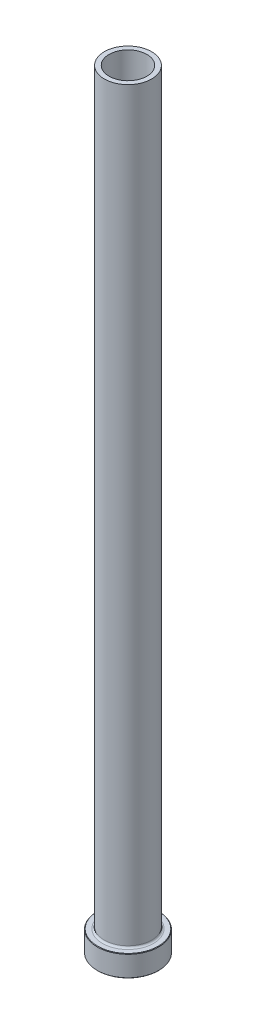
from build123d import *

# Parameters (mm, degrees)
FILLET1_R     = 0.8
CHAMFER1_SIZE = 0.2
CHAMFER3_SIZE = 0.5


with BuildPart() as part:
    # Sketch1 → Revolve1 (revolve)
    with BuildSketch(Plane.XY, mode=Mode.PRIVATE) as revolve1_sk:
        Polygon((-8, 325), (-10, 325), (-10, 9), (-13, 9), (-13, 0), (-8.25, 0), (-8.25, 258), (-8, 270), align=None)
    revolve(revolve1_sk.sketch.rotate(Axis((0, 92.187680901, 0), (0, -1, 0)), 270), axis=Axis((0, 92.187680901, 0), (0, -1, 0)))

    # Fillet1
    fillet1_edges = [part.edges().sort_by_distance(p)[0] for p in [
        (0, 9, -10),
    ]]
    fillet(fillet1_edges, radius=FILLET1_R)

    # Chamfer1
    chamfer1_edges = [part.edges().sort_by_distance(p)[0] for p in [
        (0, 0, -13),
        (0, 9, -13),
    ]]
    chamfer(chamfer1_edges, length=CHAMFER1_SIZE)

    # Chamfer3
    chamfer3_edges = [part.edges().sort_by_distance(p)[0] for p in [
        (0, 0, -8.25),
    ]]
    chamfer(chamfer3_edges, length=CHAMFER3_SIZE)


solid = part.part
